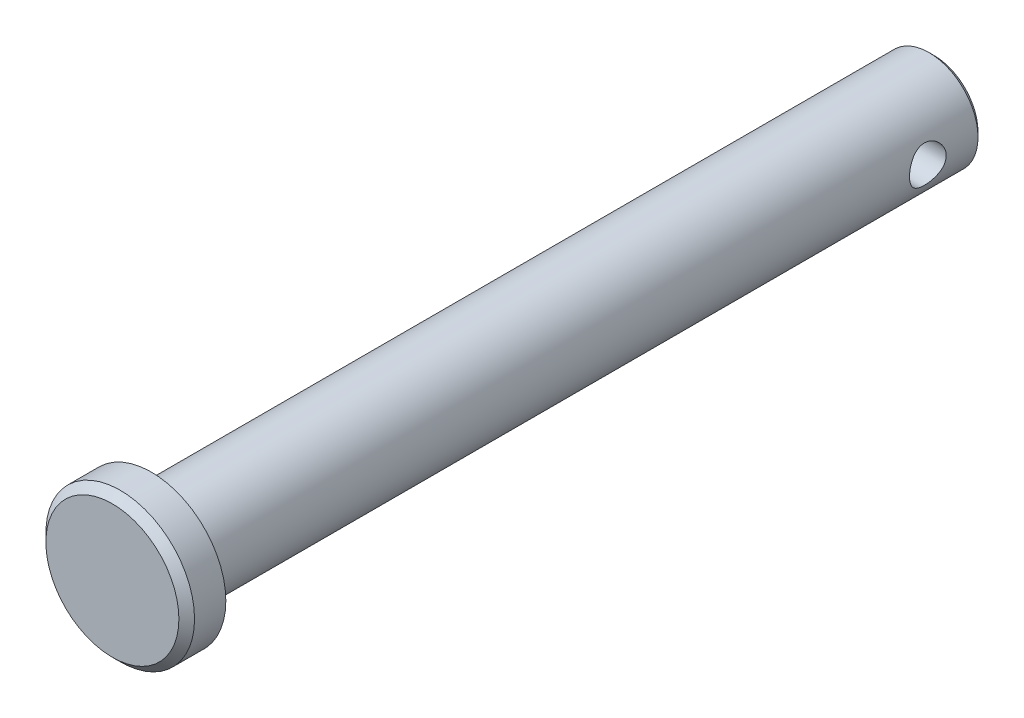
ISO-10303-21;
HEADER;
FILE_DESCRIPTION(('STEP AP214'),'2;1');
FILE_NAME('part.step','',(''),(''),'','','');
FILE_SCHEMA(('AUTOMOTIVE_DESIGN { 1 0 10303 214 1 1 1 1 }'));
ENDSEC;
DATA;
#1=APPLICATION_CONTEXT('core data for automotive mechanical design processes');
#2=APPLICATION_PROTOCOL_DEFINITION('international standard','automotive_design',2000,#1);
#3=PRODUCT_CONTEXT('',#1,'mechanical');
#4=PRODUCT('Part','Part','',(#3));
#5=PRODUCT_RELATED_PRODUCT_CATEGORY('part','',(#4));
#6=PRODUCT_DEFINITION_FORMATION('','',#4);
#7=PRODUCT_DEFINITION_CONTEXT('part definition',#1,'design');
#8=PRODUCT_DEFINITION('design','',#6,#7);
#9=PRODUCT_DEFINITION_SHAPE('','',#8);
#10=(LENGTH_UNIT() NAMED_UNIT(*) SI_UNIT(.MILLI.,.METRE.));
#11=(NAMED_UNIT(*) PLANE_ANGLE_UNIT() SI_UNIT($,.RADIAN.));
#12=(NAMED_UNIT(*) SI_UNIT($,.STERADIAN.) SOLID_ANGLE_UNIT());
#13=UNCERTAINTY_MEASURE_WITH_UNIT(LENGTH_MEASURE(1.E-05),#10,'distance_accuracy_value','');
#14=(GEOMETRIC_REPRESENTATION_CONTEXT(3) GLOBAL_UNCERTAINTY_ASSIGNED_CONTEXT((#13)) GLOBAL_UNIT_ASSIGNED_CONTEXT((#10,
#11,#12)) REPRESENTATION_CONTEXT('',''));
#15=CARTESIAN_POINT('',(0.,0.,0.));
#16=DIRECTION('',(0.,0.,1.));
#17=DIRECTION('',(1.,0.,0.));
#18=AXIS2_PLACEMENT_3D('',#15,#16,#17);
#19=CARTESIAN_POINT('',(0.,0.,25.4));
#20=DIRECTION('',(0.,0.,-1.));
#21=DIRECTION('',(-1.,0.,0.));
#22=AXIS2_PLACEMENT_3D('',#19,#20,#21);
#23=CYLINDRICAL_SURFACE('',#22,3.175);
#24=CARTESIAN_POINT('',(0.,0.,-25.0825));
#25=DIRECTION('',(0.,0.,1.));
#26=DIRECTION('',(1.,0.,0.));
#27=AXIS2_PLACEMENT_3D('',#24,#25,#26);
#28=CIRCLE('',#27,3.175);
#29=CARTESIAN_POINT('',(3.175,0.,-25.0825));
#30=VERTEX_POINT('',#29);
#31=EDGE_CURVE('E45',#30,#30,#28,.T.);
#32=ORIENTED_EDGE('',*,*,#31,.T.);
#33=EDGE_LOOP('',(#32));
#34=FACE_BOUND('',#33,.T.);
#35=CARTESIAN_POINT('',(-3.175,0.,-20.6375));
#36=CARTESIAN_POINT('',(-3.1750017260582,-0.0644803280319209,-20.6374976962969));
#37=CARTESIAN_POINT('',(-3.17301863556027,-0.128944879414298,-20.6427544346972));
#38=CARTESIAN_POINT('',(-3.16530589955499,-0.255947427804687,-20.6635573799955));
#39=CARTESIAN_POINT('',(-3.15957679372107,-0.31848570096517,-20.6791021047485));
#40=CARTESIAN_POINT('',(-3.14498698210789,-0.439785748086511,-20.7198539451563));
#41=CARTESIAN_POINT('',(-3.13613231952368,-0.498554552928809,-20.7450424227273));
#42=CARTESIAN_POINT('',(-3.11617334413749,-0.611028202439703,-20.8042719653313));
#43=CARTESIAN_POINT('',(-3.10506842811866,-0.664731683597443,-20.8383154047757));
#44=CARTESIAN_POINT('',(-3.08122833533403,-0.767831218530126,-20.9157986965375));
#45=CARTESIAN_POINT('',(-3.06844702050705,-0.816983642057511,-20.9595483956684));
#46=CARTESIAN_POINT('',(-3.04292175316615,-0.907450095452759,-21.0545445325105));
#47=CARTESIAN_POINT('',(-3.03017781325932,-0.948761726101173,-21.1057932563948));
#48=CARTESIAN_POINT('',(-3.00563336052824,-1.02392323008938,-21.2167132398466));
#49=CARTESIAN_POINT('',(-2.99388727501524,-1.05742893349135,-21.2766309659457));
#50=CARTESIAN_POINT('',(-2.97338639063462,-1.1137792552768,-21.4017608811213));
#51=CARTESIAN_POINT('',(-2.96463039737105,-1.13662813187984,-21.4669709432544));
#52=CARTESIAN_POINT('',(-2.95159440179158,-1.1700544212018,-21.5980301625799));
#53=CARTESIAN_POINT('',(-2.94714552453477,-1.18109677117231,-21.6637433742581));
#54=CARTESIAN_POINT('',(-2.94273336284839,-1.19205022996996,-21.7962290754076));
#55=CARTESIAN_POINT('',(-2.94276822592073,-1.19196593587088,-21.8630011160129));
#56=CARTESIAN_POINT('',(-2.94717399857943,-1.18102403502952,-21.9914545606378));
#57=CARTESIAN_POINT('',(-2.95128528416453,-1.17081148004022,-22.0532014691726));
#58=CARTESIAN_POINT('',(-2.96294919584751,-1.14096933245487,-22.1740310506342));
#59=CARTESIAN_POINT('',(-2.97050234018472,-1.12133832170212,-22.2331133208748));
#60=CARTESIAN_POINT('',(-2.98835526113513,-1.07286225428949,-22.3482511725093));
#61=CARTESIAN_POINT('',(-2.99870429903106,-1.04384989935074,-22.4042283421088));
#62=CARTESIAN_POINT('',(-3.02096654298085,-0.977551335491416,-22.5107069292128));
#63=CARTESIAN_POINT('',(-3.03288028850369,-0.940262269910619,-22.5612064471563));
#64=CARTESIAN_POINT('',(-3.05790630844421,-0.855517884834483,-22.6588666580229));
#65=CARTESIAN_POINT('',(-3.07104532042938,-0.807547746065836,-22.7055748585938));
#66=CARTESIAN_POINT('',(-3.09635309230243,-0.7043043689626,-22.7904182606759));
#67=CARTESIAN_POINT('',(-3.10852170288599,-0.649030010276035,-22.8285521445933));
#68=CARTESIAN_POINT('',(-3.13075950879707,-0.531592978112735,-22.8956635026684));
#69=CARTESIAN_POINT('',(-3.1407933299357,-0.469337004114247,-22.9244902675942));
#70=CARTESIAN_POINT('',(-3.15736857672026,-0.340389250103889,-22.9711111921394));
#71=CARTESIAN_POINT('',(-3.1639115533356,-0.273699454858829,-22.9889102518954));
#72=CARTESIAN_POINT('',(-3.17249526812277,-0.141585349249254,-23.0121005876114));
#73=CARTESIAN_POINT('',(-3.17475686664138,-0.0762822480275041,-23.0181011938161));
#74=CARTESIAN_POINT('',(-3.17520553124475,0.0544294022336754,-23.0192985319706));
#75=CARTESIAN_POINT('',(-3.17339350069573,0.119837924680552,-23.0144976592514));
#76=CARTESIAN_POINT('',(-3.16604419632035,0.246270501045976,-22.9946914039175));
#77=CARTESIAN_POINT('',(-3.16065273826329,0.307366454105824,-22.9800852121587));
#78=CARTESIAN_POINT('',(-3.1468335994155,0.426197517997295,-22.9416085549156));
#79=CARTESIAN_POINT('',(-3.13840552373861,0.483932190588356,-22.9177368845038));
#80=CARTESIAN_POINT('',(-3.11903764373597,0.596302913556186,-22.8606457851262));
#81=CARTESIAN_POINT('',(-3.1080313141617,0.650798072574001,-22.8271723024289));
#82=CARTESIAN_POINT('',(-3.08472420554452,0.75358046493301,-22.7521150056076));
#83=CARTESIAN_POINT('',(-3.07242294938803,0.801865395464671,-22.7105281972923));
#84=CARTESIAN_POINT('',(-3.04699455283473,0.893786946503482,-22.6175854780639));
#85=CARTESIAN_POINT('',(-3.03386090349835,0.936991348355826,-22.5658027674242));
#86=CARTESIAN_POINT('',(-3.00893809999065,1.01418270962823,-22.4554642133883));
#87=CARTESIAN_POINT('',(-2.99714906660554,1.04816884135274,-22.3969077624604));
#88=CARTESIAN_POINT('',(-2.9762992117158,1.10599357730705,-22.2741998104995));
#89=CARTESIAN_POINT('',(-2.96724991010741,1.12978950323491,-22.2100261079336));
#90=CARTESIAN_POINT('',(-2.95317888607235,1.16608132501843,-22.0781485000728));
#91=CARTESIAN_POINT('',(-2.94815467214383,1.17858421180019,-22.0104468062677));
#92=CARTESIAN_POINT('',(-2.94303366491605,1.1913103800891,-21.8781184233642));
#93=CARTESIAN_POINT('',(-2.94264115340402,1.19227069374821,-21.8135734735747));
#94=CARTESIAN_POINT('',(-2.94606990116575,1.18377268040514,-21.6852934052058));
#95=CARTESIAN_POINT('',(-2.94989076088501,1.17431534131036,-21.6215582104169));
#96=CARTESIAN_POINT('',(-2.96106962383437,1.14582428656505,-21.4986812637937));
#97=CARTESIAN_POINT('',(-2.96831611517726,1.12709164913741,-21.4394586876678));
#98=CARTESIAN_POINT('',(-2.98546478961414,1.08084696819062,-21.3249625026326));
#99=CARTESIAN_POINT('',(-2.99536764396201,1.0533327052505,-21.2696898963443));
#100=CARTESIAN_POINT('',(-3.01735905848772,0.9886321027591,-21.1615124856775));
#101=CARTESIAN_POINT('',(-3.02953498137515,0.951014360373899,-21.1088836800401));
#102=CARTESIAN_POINT('',(-3.05439958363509,0.867842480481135,-21.0104501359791));
#103=CARTESIAN_POINT('',(-3.06708842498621,0.822285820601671,-20.964647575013));
#104=CARTESIAN_POINT('',(-3.09237399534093,0.721582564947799,-20.8786396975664));
#105=CARTESIAN_POINT('',(-3.10492858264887,0.666050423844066,-20.8388713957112));
#106=CARTESIAN_POINT('',(-3.12780770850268,0.548650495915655,-20.7692445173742));
#107=CARTESIAN_POINT('',(-3.13813207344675,0.486782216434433,-20.7393867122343));
#108=CARTESIAN_POINT('',(-3.15574594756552,0.355599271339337,-20.6895883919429));
#109=CARTESIAN_POINT('',(-3.16288465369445,0.286078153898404,-20.6701333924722));
#110=CARTESIAN_POINT('',(-3.17250954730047,0.144363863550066,-20.644093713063));
#111=CARTESIAN_POINT('',(-3.17499806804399,0.0721720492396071,-20.6375025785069));
#112=CARTESIAN_POINT('',(-3.175,0.,-20.6375));
#113=B_SPLINE_CURVE_WITH_KNOTS('',3,(#35,#36,#37,#38,#39,#40,#41,#42,#43,#44,#45,#46,#47,#48,
#49,#50,#51,#52,#53,#54,#55,#56,#57,#58,#59,#60,#61,#62,#63,#64,#65,#66,#67,#68,#69,#70,#71,#72,
#73,#74,#75,#76,#77,#78,#79,#80,#81,#82,#83,#84,#85,#86,#87,#88,#89,#90,#91,#92,#93,#94,#95,#96,
#97,#98,#99,#100,#101,#102,#103,#104,#105,#106,#107,#108,#109,#110,#111,#112),.UNSPECIFIED.,.T.,
.F.,(4,2,2,2,2,2,2,2,2,2,2,2,2,2,2,2,2,2,2,2,2,2,2,2,2,2,2,2,2,2,2,2,2,2,2,2,2,2,4),(0.,
0.193174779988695,0.386321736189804,0.579097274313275,0.771924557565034,0.972134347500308,
1.17240530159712,1.38030485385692,1.58812126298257,1.78741287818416,1.98662215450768,
2.17390936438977,2.36122478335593,2.55208411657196,2.74300942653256,2.94676634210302,
3.15055454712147,3.35749404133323,3.5643415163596,3.76019234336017,3.95599974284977,
4.14428335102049,4.33259145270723,4.52643257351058,4.72034536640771,4.92550862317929,
5.13069029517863,5.33672309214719,5.54262825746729,5.73531018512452,5.92797384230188,
6.11475744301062,6.30158828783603,6.49821274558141,6.69489978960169,6.90223036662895,
7.10957707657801,7.32590383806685,7.54212202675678),.UNSPECIFIED.);
#114=CARTESIAN_POINT('',(-3.175,0.,-20.6375));
#115=VERTEX_POINT('',#114);
#116=EDGE_CURVE('E58',#115,#115,#113,.T.);
#117=ORIENTED_EDGE('',*,*,#116,.T.);
#118=EDGE_LOOP('',(#117));
#119=FACE_BOUND('',#118,.T.);
#120=CARTESIAN_POINT('',(3.175,0.,-23.01875));
#121=CARTESIAN_POINT('',(3.1750017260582,-0.0644803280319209,-23.0187523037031));
#122=CARTESIAN_POINT('',(3.17301863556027,-0.128944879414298,-23.0134955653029));
#123=CARTESIAN_POINT('',(3.16530589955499,-0.255947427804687,-22.9926926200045));
#124=CARTESIAN_POINT('',(3.15957679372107,-0.31848570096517,-22.9771478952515));
#125=CARTESIAN_POINT('',(3.14498698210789,-0.439785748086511,-22.9363960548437));
#126=CARTESIAN_POINT('',(3.13613231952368,-0.49855455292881,-22.9112075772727));
#127=CARTESIAN_POINT('',(3.11617334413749,-0.611028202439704,-22.8519780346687));
#128=CARTESIAN_POINT('',(3.10506842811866,-0.664731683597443,-22.8179345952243));
#129=CARTESIAN_POINT('',(3.08122833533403,-0.767831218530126,-22.7404513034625));
#130=CARTESIAN_POINT('',(3.06844702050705,-0.816983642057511,-22.6967016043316));
#131=CARTESIAN_POINT('',(3.04292175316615,-0.907450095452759,-22.6017054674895));
#132=CARTESIAN_POINT('',(3.03017781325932,-0.948761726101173,-22.5504567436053));
#133=CARTESIAN_POINT('',(3.00563336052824,-1.02392323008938,-22.4395367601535));
#134=CARTESIAN_POINT('',(2.99388727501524,-1.05742893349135,-22.3796190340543));
#135=CARTESIAN_POINT('',(2.97338639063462,-1.1137792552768,-22.2544891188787));
#136=CARTESIAN_POINT('',(2.96463039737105,-1.13662813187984,-22.1892790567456));
#137=CARTESIAN_POINT('',(2.95159440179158,-1.1700544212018,-22.0582198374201));
#138=CARTESIAN_POINT('',(2.94714552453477,-1.18109677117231,-21.9925066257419));
#139=CARTESIAN_POINT('',(2.94273336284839,-1.19205022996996,-21.8600209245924));
#140=CARTESIAN_POINT('',(2.94276822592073,-1.19196593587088,-21.7932488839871));
#141=CARTESIAN_POINT('',(2.94717399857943,-1.18102403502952,-21.6647954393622));
#142=CARTESIAN_POINT('',(2.95128528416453,-1.17081148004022,-21.6030485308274));
#143=CARTESIAN_POINT('',(2.96294919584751,-1.14096933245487,-21.4822189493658));
#144=CARTESIAN_POINT('',(2.97050234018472,-1.12133832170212,-21.4231366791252));
#145=CARTESIAN_POINT('',(2.98835526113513,-1.07286225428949,-21.3079988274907));
#146=CARTESIAN_POINT('',(2.99870429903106,-1.04384989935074,-21.2520216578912));
#147=CARTESIAN_POINT('',(3.02096654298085,-0.977551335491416,-21.1455430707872));
#148=CARTESIAN_POINT('',(3.03288028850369,-0.940262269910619,-21.0950435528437));
#149=CARTESIAN_POINT('',(3.05790630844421,-0.855517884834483,-20.9973833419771));
#150=CARTESIAN_POINT('',(3.07104532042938,-0.807547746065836,-20.9506751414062));
#151=CARTESIAN_POINT('',(3.09635309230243,-0.7043043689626,-20.8658317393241));
#152=CARTESIAN_POINT('',(3.10852170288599,-0.649030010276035,-20.8276978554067));
#153=CARTESIAN_POINT('',(3.13075950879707,-0.531592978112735,-20.7605864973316));
#154=CARTESIAN_POINT('',(3.1407933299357,-0.469337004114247,-20.7317597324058));
#155=CARTESIAN_POINT('',(3.15736857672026,-0.340389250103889,-20.6851388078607));
#156=CARTESIAN_POINT('',(3.1639115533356,-0.273699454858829,-20.6673397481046));
#157=CARTESIAN_POINT('',(3.17249526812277,-0.141585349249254,-20.6441494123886));
#158=CARTESIAN_POINT('',(3.17475686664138,-0.0762822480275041,-20.6381488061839));
#159=CARTESIAN_POINT('',(3.17520553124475,0.0544294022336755,-20.6369514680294));
#160=CARTESIAN_POINT('',(3.17339350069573,0.119837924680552,-20.6417523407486));
#161=CARTESIAN_POINT('',(3.16604419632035,0.246270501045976,-20.6615585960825));
#162=CARTESIAN_POINT('',(3.16065273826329,0.307366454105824,-20.6761647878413));
#163=CARTESIAN_POINT('',(3.1468335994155,0.426197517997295,-20.7146414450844));
#164=CARTESIAN_POINT('',(3.13840552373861,0.483932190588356,-20.7385131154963));
#165=CARTESIAN_POINT('',(3.11903764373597,0.596302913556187,-20.7956042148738));
#166=CARTESIAN_POINT('',(3.1080313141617,0.650798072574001,-20.8290776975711));
#167=CARTESIAN_POINT('',(3.08472420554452,0.75358046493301,-20.9041349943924));
#168=CARTESIAN_POINT('',(3.07242294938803,0.801865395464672,-20.9457218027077));
#169=CARTESIAN_POINT('',(3.04699455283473,0.893786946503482,-21.0386645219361));
#170=CARTESIAN_POINT('',(3.03386090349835,0.936991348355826,-21.0904472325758));
#171=CARTESIAN_POINT('',(3.00893809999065,1.01418270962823,-21.2007857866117));
#172=CARTESIAN_POINT('',(2.99714906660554,1.04816884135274,-21.2593422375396));
#173=CARTESIAN_POINT('',(2.9762992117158,1.10599357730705,-21.3820501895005));
#174=CARTESIAN_POINT('',(2.96724991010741,1.12978950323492,-21.4462238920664));
#175=CARTESIAN_POINT('',(2.95317888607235,1.16608132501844,-21.5781014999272));
#176=CARTESIAN_POINT('',(2.94815467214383,1.17858421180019,-21.6458031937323));
#177=CARTESIAN_POINT('',(2.94303366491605,1.1913103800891,-21.7781315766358));
#178=CARTESIAN_POINT('',(2.94264115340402,1.19227069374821,-21.8426765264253));
#179=CARTESIAN_POINT('',(2.94606990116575,1.18377268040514,-21.9709565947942));
#180=CARTESIAN_POINT('',(2.94989076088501,1.17431534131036,-22.0346917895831));
#181=CARTESIAN_POINT('',(2.96106962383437,1.14582428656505,-22.1575687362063));
#182=CARTESIAN_POINT('',(2.96831611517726,1.12709164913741,-22.2167913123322));
#183=CARTESIAN_POINT('',(2.98546478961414,1.08084696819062,-22.3312874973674));
#184=CARTESIAN_POINT('',(2.99536764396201,1.0533327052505,-22.3865601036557));
#185=CARTESIAN_POINT('',(3.01735905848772,0.9886321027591,-22.4947375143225));
#186=CARTESIAN_POINT('',(3.02953498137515,0.951014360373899,-22.5473663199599));
#187=CARTESIAN_POINT('',(3.05439958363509,0.867842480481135,-22.6457998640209));
#188=CARTESIAN_POINT('',(3.06708842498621,0.822285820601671,-22.691602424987));
#189=CARTESIAN_POINT('',(3.09237399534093,0.721582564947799,-22.7776103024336));
#190=CARTESIAN_POINT('',(3.10492858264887,0.666050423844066,-22.8173786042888));
#191=CARTESIAN_POINT('',(3.12780770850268,0.548650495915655,-22.8870054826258));
#192=CARTESIAN_POINT('',(3.13813207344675,0.486782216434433,-22.9168632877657));
#193=CARTESIAN_POINT('',(3.15574594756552,0.355599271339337,-22.9666616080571));
#194=CARTESIAN_POINT('',(3.16288465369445,0.286078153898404,-22.9861166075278));
#195=CARTESIAN_POINT('',(3.17250954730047,0.144363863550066,-23.012156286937));
#196=CARTESIAN_POINT('',(3.17499806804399,0.0721720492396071,-23.0187474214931));
#197=CARTESIAN_POINT('',(3.175,0.,-23.01875));
#198=B_SPLINE_CURVE_WITH_KNOTS('',3,(#120,#121,#122,#123,#124,#125,#126,#127,#128,#129,#130,
#131,#132,#133,#134,#135,#136,#137,#138,#139,#140,#141,#142,#143,#144,#145,#146,#147,#148,#149,
#150,#151,#152,#153,#154,#155,#156,#157,#158,#159,#160,#161,#162,#163,#164,#165,#166,#167,#168,
#169,#170,#171,#172,#173,#174,#175,#176,#177,#178,#179,#180,#181,#182,#183,#184,#185,#186,#187,
#188,#189,#190,#191,#192,#193,#194,#195,#196,#197),.UNSPECIFIED.,.T.,.F.,(4,2,2,2,2,2,2,2,2,2,2,
2,2,2,2,2,2,2,2,2,2,2,2,2,2,2,2,2,2,2,2,2,2,2,2,2,2,2,4),(0.,0.193174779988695,
0.386321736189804,0.579097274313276,0.771924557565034,0.972134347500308,1.17240530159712,
1.38030485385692,1.58812126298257,1.78741287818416,1.98662215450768,2.17390936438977,
2.36122478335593,2.55208411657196,2.74300942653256,2.94676634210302,3.15055454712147,
3.35749404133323,3.5643415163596,3.76019234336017,3.95599974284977,4.14428335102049,
4.33259145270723,4.52643257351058,4.72034536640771,4.92550862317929,5.13069029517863,
5.3367230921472,5.54262825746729,5.73531018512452,5.92797384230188,6.11475744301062,
6.30158828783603,6.49821274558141,6.69489978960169,6.90223036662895,7.10957707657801,
7.32590383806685,7.54212202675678),.UNSPECIFIED.);
#199=CARTESIAN_POINT('',(3.175,0.,-23.01875));
#200=VERTEX_POINT('',#199);
#201=EDGE_CURVE('E68',#200,#200,#198,.T.);
#202=ORIENTED_EDGE('',*,*,#201,.T.);
#203=EDGE_LOOP('',(#202));
#204=FACE_BOUND('',#203,.T.);
#205=CARTESIAN_POINT('',(0.,0.,25.4));
#206=DIRECTION('',(0.,0.,1.));
#207=DIRECTION('',(1.,0.,0.));
#208=AXIS2_PLACEMENT_3D('',#205,#206,#207);
#209=CIRCLE('',#208,3.175);
#210=CARTESIAN_POINT('',(3.175,0.,25.4));
#211=VERTEX_POINT('',#210);
#212=EDGE_CURVE('E107',#211,#211,#209,.T.);
#213=ORIENTED_EDGE('',*,*,#212,.F.);
#214=EDGE_LOOP('',(#213));
#215=FACE_BOUND('',#214,.T.);
#216=ADVANCED_FACE('F37',(#34,#119,#204,#215),#23,.T.);
#217=CARTESIAN_POINT('',(0.,0.,-25.4));
#218=DIRECTION('',(0.,0.,1.));
#219=DIRECTION('',(1.,0.,0.));
#220=AXIS2_PLACEMENT_3D('',#217,#218,#219);
#221=PLANE('',#220);
#222=CARTESIAN_POINT('',(0.,0.,-25.4));
#223=DIRECTION('',(0.,0.,1.));
#224=DIRECTION('',(1.,0.,0.));
#225=AXIS2_PLACEMENT_3D('',#222,#223,#224);
#226=CIRCLE('',#225,2.85749999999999);
#227=CARTESIAN_POINT('',(2.85749999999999,0.,-25.4));
#228=VERTEX_POINT('',#227);
#229=EDGE_CURVE('E10',#228,#228,#226,.F.);
#230=ORIENTED_EDGE('',*,*,#229,.T.);
#231=EDGE_LOOP('',(#230));
#232=FACE_BOUND('',#231,.T.);
#233=ADVANCED_FACE('F89',(#232),#221,.F.);
#234=CARTESIAN_POINT('',(0.,0.,25.4));
#235=DIRECTION('',(0.,0.,1.));
#236=DIRECTION('',(1.,0.,0.));
#237=AXIS2_PLACEMENT_3D('',#234,#235,#236);
#238=PLANE('',#237);
#239=CARTESIAN_POINT('',(0.,0.,25.4));
#240=DIRECTION('',(0.,0.,1.));
#241=DIRECTION('',(1.,0.,0.));
#242=AXIS2_PLACEMENT_3D('',#239,#240,#241);
#243=CIRCLE('',#242,4.826);
#244=CARTESIAN_POINT('',(4.826,0.,25.4));
#245=VERTEX_POINT('',#244);
#246=EDGE_CURVE('E67',#245,#245,#243,.T.);
#247=ORIENTED_EDGE('',*,*,#246,.F.);
#248=EDGE_LOOP('',(#247));
#249=FACE_BOUND('',#248,.T.);
#250=ORIENTED_EDGE('',*,*,#212,.T.);
#251=EDGE_LOOP('',(#250));
#252=FACE_BOUND('',#251,.T.);
#253=ADVANCED_FACE('F86',(#249,#252),#238,.F.);
#254=CARTESIAN_POINT('',(0.,0.,27.94));
#255=DIRECTION('',(0.,0.,-1.));
#256=DIRECTION('',(-1.,0.,0.));
#257=AXIS2_PLACEMENT_3D('',#254,#255,#256);
#258=CYLINDRICAL_SURFACE('',#257,4.826);
#259=CARTESIAN_POINT('',(0.,0.,27.432));
#260=DIRECTION('',(0.,0.,1.));
#261=DIRECTION('',(1.,0.,0.));
#262=AXIS2_PLACEMENT_3D('',#259,#260,#261);
#263=CIRCLE('',#262,4.826);
#264=CARTESIAN_POINT('',(4.826,0.,27.432));
#265=VERTEX_POINT('',#264);
#266=EDGE_CURVE('E50',#265,#265,#263,.F.);
#267=ORIENTED_EDGE('',*,*,#266,.T.);
#268=EDGE_LOOP('',(#267));
#269=FACE_BOUND('',#268,.T.);
#270=ORIENTED_EDGE('',*,*,#246,.T.);
#271=EDGE_LOOP('',(#270));
#272=FACE_BOUND('',#271,.T.);
#273=ADVANCED_FACE('F84',(#269,#272),#258,.T.);
#274=CARTESIAN_POINT('',(0.,0.,27.94));
#275=DIRECTION('',(0.,0.,1.));
#276=DIRECTION('',(1.,0.,0.));
#277=AXIS2_PLACEMENT_3D('',#274,#275,#276);
#278=PLANE('',#277);
#279=CARTESIAN_POINT('',(0.,0.,27.94));
#280=DIRECTION('',(0.,0.,1.));
#281=DIRECTION('',(1.,0.,0.));
#282=AXIS2_PLACEMENT_3D('',#279,#280,#281);
#283=CIRCLE('',#282,4.31799999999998);
#284=CARTESIAN_POINT('',(4.31799999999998,0.,27.94));
#285=VERTEX_POINT('',#284);
#286=EDGE_CURVE('E55',#285,#285,#283,.T.);
#287=ORIENTED_EDGE('',*,*,#286,.T.);
#288=EDGE_LOOP('',(#287));
#289=FACE_BOUND('',#288,.T.);
#290=ADVANCED_FACE('F80',(#289),#278,.T.);
#291=CARTESIAN_POINT('',(0.,0.,27.94));
#292=DIRECTION('',(0.,0.,-1.));
#293=DIRECTION('',(-1.,0.,0.));
#294=AXIS2_PLACEMENT_3D('',#291,#292,#293);
#295=CONICAL_SURFACE('',#294,4.31799999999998,0.785398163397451);
#296=ORIENTED_EDGE('',*,*,#266,.F.);
#297=EDGE_LOOP('',(#296));
#298=FACE_BOUND('',#297,.T.);
#299=ORIENTED_EDGE('',*,*,#286,.F.);
#300=EDGE_LOOP('',(#299));
#301=FACE_BOUND('',#300,.T.);
#302=ADVANCED_FACE('F78',(#298,#301),#295,.T.);
#303=CARTESIAN_POINT('',(-4.826,0.,-21.828125));
#304=DIRECTION('',(1.,0.,0.));
#305=DIRECTION('',(0.,0.,-1.));
#306=AXIS2_PLACEMENT_3D('',#303,#304,#305);
#307=CYLINDRICAL_SURFACE('',#306,1.190625);
#308=ORIENTED_EDGE('',*,*,#201,.F.);
#309=EDGE_LOOP('',(#308));
#310=FACE_BOUND('',#309,.T.);
#311=ORIENTED_EDGE('',*,*,#116,.F.);
#312=EDGE_LOOP('',(#311));
#313=FACE_BOUND('',#312,.T.);
#314=ADVANCED_FACE('F74',(#310,#313),#307,.F.);
#315=CARTESIAN_POINT('',(0.,0.,-25.0825));
#316=DIRECTION('',(0.,0.,1.));
#317=DIRECTION('',(1.,0.,0.));
#318=AXIS2_PLACEMENT_3D('',#315,#316,#317);
#319=CONICAL_SURFACE('',#318,3.175,0.785398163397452);
#320=ORIENTED_EDGE('',*,*,#229,.F.);
#321=EDGE_LOOP('',(#320));
#322=FACE_BOUND('',#321,.T.);
#323=ORIENTED_EDGE('',*,*,#31,.F.);
#324=EDGE_LOOP('',(#323));
#325=FACE_BOUND('',#324,.T.);
#326=ADVANCED_FACE('F39',(#322,#325),#319,.T.);
#327=CLOSED_SHELL('',(#216,#233,#253,#273,#290,#302,#314,#326));
#328=MANIFOLD_SOLID_BREP('B2',#327);
#329=ADVANCED_BREP_SHAPE_REPRESENTATION('',(#18,#328),#14);
#330=SHAPE_DEFINITION_REPRESENTATION(#9,#329);
ENDSEC;
END-ISO-10303-21;
